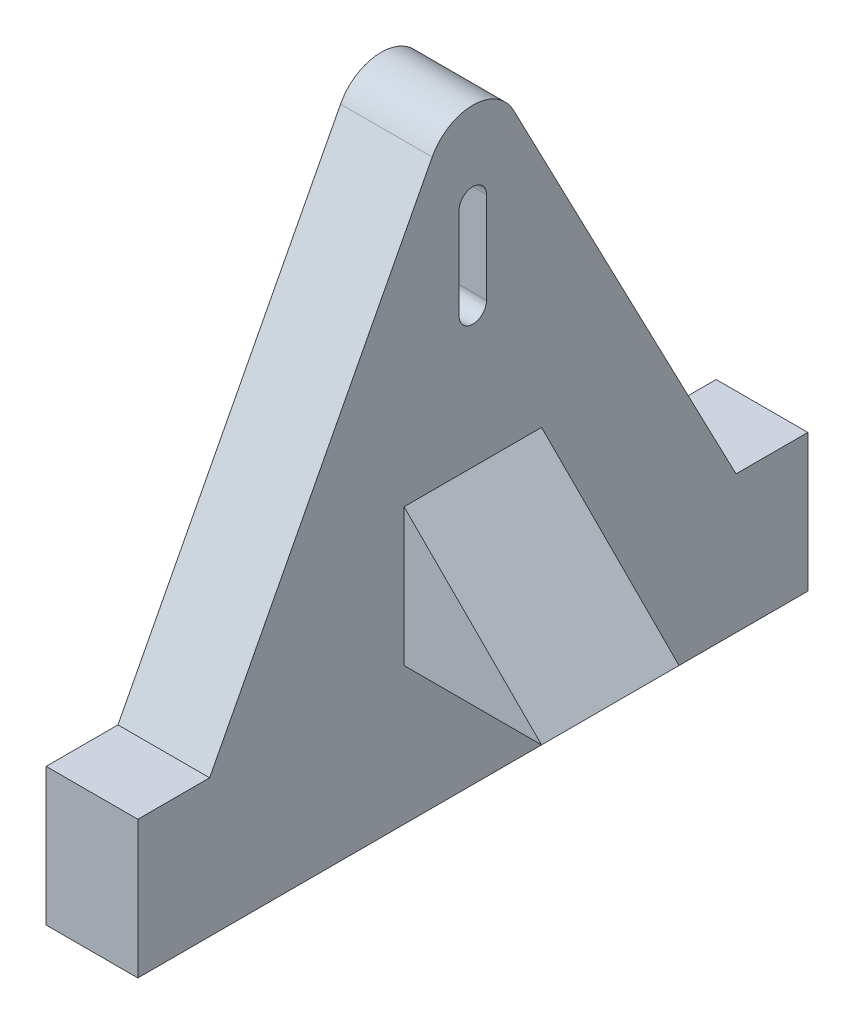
ISO-10303-21;
HEADER;
FILE_DESCRIPTION(('STEP AP214'),'2;1');
FILE_NAME('part.step','',(''),(''),'','','');
FILE_SCHEMA(('AUTOMOTIVE_DESIGN { 1 0 10303 214 1 1 1 1 }'));
ENDSEC;
DATA;
#1=APPLICATION_CONTEXT('core data for automotive mechanical design processes');
#2=APPLICATION_PROTOCOL_DEFINITION('international standard','automotive_design',2000,#1);
#3=PRODUCT_CONTEXT('',#1,'mechanical');
#4=PRODUCT('Part','Part','',(#3));
#5=PRODUCT_RELATED_PRODUCT_CATEGORY('part','',(#4));
#6=PRODUCT_DEFINITION_FORMATION('','',#4);
#7=PRODUCT_DEFINITION_CONTEXT('part definition',#1,'design');
#8=PRODUCT_DEFINITION('design','',#6,#7);
#9=PRODUCT_DEFINITION_SHAPE('','',#8);
#10=(LENGTH_UNIT() NAMED_UNIT(*) SI_UNIT(.MILLI.,.METRE.));
#11=(NAMED_UNIT(*) PLANE_ANGLE_UNIT() SI_UNIT($,.RADIAN.));
#12=(NAMED_UNIT(*) SI_UNIT($,.STERADIAN.) SOLID_ANGLE_UNIT());
#13=UNCERTAINTY_MEASURE_WITH_UNIT(LENGTH_MEASURE(1.E-05),#10,'distance_accuracy_value','');
#14=(GEOMETRIC_REPRESENTATION_CONTEXT(3) GLOBAL_UNCERTAINTY_ASSIGNED_CONTEXT((#13)) GLOBAL_UNIT_ASSIGNED_CONTEXT((#10,
#11,#12)) REPRESENTATION_CONTEXT('',''));
#15=CARTESIAN_POINT('',(0.,0.,0.));
#16=DIRECTION('',(0.,0.,1.));
#17=DIRECTION('',(1.,0.,0.));
#18=AXIS2_PLACEMENT_3D('',#15,#16,#17);
#19=CARTESIAN_POINT('',(30.,53.0229705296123,8.86438992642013));
#20=DIRECTION('',(0.,-0.462845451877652,-0.886438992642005));
#21=DIRECTION('',(0.,0.886438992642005,-0.462845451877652));
#22=AXIS2_PLACEMENT_3D('',#19,#20,#21);
#23=PLANE('',#22);
#24=DIRECTION('',(-1.,0.,0.));
#25=VECTOR('',#24,1.);
#26=CARTESIAN_POINT('',(30.,53.0229705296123,8.86438992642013));
#27=LINE('',#26,#25);
#28=CARTESIAN_POINT('',(30.,53.0229705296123,8.86438992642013));
#29=VERTEX_POINT('',#28);
#30=CARTESIAN_POINT('',(10.,53.0229705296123,8.86438992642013));
#31=VERTEX_POINT('',#30);
#32=EDGE_CURVE('E48',#29,#31,#27,.T.);
#33=ORIENTED_EDGE('',*,*,#32,.T.);
#34=DIRECTION('',(0.,-0.886438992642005,0.462845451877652));
#35=VECTOR('',#34,1.);
#36=CARTESIAN_POINT('',(10.,53.0229705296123,8.86438992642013));
#37=LINE('',#36,#35);
#38=CARTESIAN_POINT('',(10.,-40.,57.4354243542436));
#39=VERTEX_POINT('',#38);
#40=EDGE_CURVE('E249',#31,#39,#37,.T.);
#41=ORIENTED_EDGE('',*,*,#40,.T.);
#42=DIRECTION('',(-1.,0.,0.));
#43=VECTOR('',#42,1.);
#44=CARTESIAN_POINT('',(30.,-40.,57.4354243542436));
#45=LINE('',#44,#43);
#46=CARTESIAN_POINT('',(30.,-40.,57.4354243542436));
#47=VERTEX_POINT('',#46);
#48=EDGE_CURVE('E212',#47,#39,#45,.T.);
#49=ORIENTED_EDGE('',*,*,#48,.F.);
#50=DIRECTION('',(0.,-0.886438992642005,0.462845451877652));
#51=VECTOR('',#50,1.);
#52=CARTESIAN_POINT('',(30.,53.0229705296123,8.86438992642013));
#53=LINE('',#52,#51);
#54=EDGE_CURVE('E218',#29,#47,#53,.T.);
#55=ORIENTED_EDGE('',*,*,#54,.F.);
#56=EDGE_LOOP('',(#33,#41,#49,#55));
#57=FACE_BOUND('',#56,.T.);
#58=ADVANCED_FACE('F40',(#57),#23,.F.);
#59=CARTESIAN_POINT('',(30.,53.0229705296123,-8.86438992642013));
#60=DIRECTION('',(0.,0.462845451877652,-0.886438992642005));
#61=DIRECTION('',(0.,0.886438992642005,0.462845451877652));
#62=AXIS2_PLACEMENT_3D('',#59,#60,#61);
#63=PLANE('',#62);
#64=DIRECTION('',(0.,-0.886438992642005,-0.462845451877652));
#65=VECTOR('',#64,1.);
#66=CARTESIAN_POINT('',(10.,53.0229705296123,-8.86438992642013));
#67=LINE('',#66,#65);
#68=CARTESIAN_POINT('',(10.,53.0229705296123,-8.86438992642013));
#69=VERTEX_POINT('',#68);
#70=CARTESIAN_POINT('',(10.,-40.,-57.4354243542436));
#71=VERTEX_POINT('',#70);
#72=EDGE_CURVE('E255',#69,#71,#67,.T.);
#73=ORIENTED_EDGE('',*,*,#72,.F.);
#74=DIRECTION('',(-1.,0.,0.));
#75=VECTOR('',#74,1.);
#76=CARTESIAN_POINT('',(30.,53.0229705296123,-8.86438992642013));
#77=LINE('',#76,#75);
#78=CARTESIAN_POINT('',(30.,53.0229705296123,-8.86438992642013));
#79=VERTEX_POINT('',#78);
#80=EDGE_CURVE('E168',#79,#69,#77,.T.);
#81=ORIENTED_EDGE('',*,*,#80,.F.);
#82=DIRECTION('',(0.,-0.886438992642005,-0.462845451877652));
#83=VECTOR('',#82,1.);
#84=CARTESIAN_POINT('',(30.,53.0229705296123,-8.86438992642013));
#85=LINE('',#84,#83);
#86=CARTESIAN_POINT('',(30.,-40.,-57.4354243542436));
#87=VERTEX_POINT('',#86);
#88=EDGE_CURVE('E172',#79,#87,#85,.T.);
#89=ORIENTED_EDGE('',*,*,#88,.T.);
#90=DIRECTION('',(-1.,0.,0.));
#91=VECTOR('',#90,1.);
#92=CARTESIAN_POINT('',(30.,-40.,-57.4354243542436));
#93=LINE('',#92,#91);
#94=EDGE_CURVE('E208',#87,#71,#93,.T.);
#95=ORIENTED_EDGE('',*,*,#94,.T.);
#96=EDGE_LOOP('',(#73,#81,#89,#95));
#97=FACE_BOUND('',#96,.T.);
#98=ADVANCED_FACE('F225',(#97),#63,.T.);
#99=CARTESIAN_POINT('',(30.,48.394516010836,0.));
#100=DIRECTION('',(-1.,0.,0.));
#101=DIRECTION('',(0.,0.,1.));
#102=AXIS2_PLACEMENT_3D('',#99,#100,#101);
#103=CYLINDRICAL_SURFACE('',#102,10.);
#104=ORIENTED_EDGE('',*,*,#80,.T.);
#105=CARTESIAN_POINT('',(10.,48.394516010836,0.));
#106=DIRECTION('',(1.,0.,0.));
#107=DIRECTION('',(0.,0.,-1.));
#108=AXIS2_PLACEMENT_3D('',#105,#106,#107);
#109=CIRCLE('',#108,10.);
#110=EDGE_CURVE('E252',#69,#31,#109,.T.);
#111=ORIENTED_EDGE('',*,*,#110,.T.);
#112=ORIENTED_EDGE('',*,*,#32,.F.);
#113=CARTESIAN_POINT('',(30.,48.394516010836,0.));
#114=DIRECTION('',(1.,0.,0.));
#115=DIRECTION('',(0.,0.,-1.));
#116=AXIS2_PLACEMENT_3D('',#113,#114,#115);
#117=CIRCLE('',#116,10.);
#118=EDGE_CURVE('E215',#79,#29,#117,.T.);
#119=ORIENTED_EDGE('',*,*,#118,.F.);
#120=EDGE_LOOP('',(#104,#111,#112,#119));
#121=FACE_BOUND('',#120,.T.);
#122=ADVANCED_FACE('F42',(#121),#103,.T.);
#123=CARTESIAN_POINT('',(30.,-70.,73.09963099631));
#124=DIRECTION('',(0.,1.,0.));
#125=DIRECTION('',(0.,0.,1.));
#126=AXIS2_PLACEMENT_3D('',#123,#124,#125);
#127=PLANE('',#126);
#128=DIRECTION('',(-1.,0.,0.));
#129=VECTOR('',#128,1.);
#130=CARTESIAN_POINT('',(30.,-70.,73.09963099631));
#131=LINE('',#130,#129);
#132=CARTESIAN_POINT('',(30.,-70.,73.09963099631));
#133=VERTEX_POINT('',#132);
#134=CARTESIAN_POINT('',(10.,-70.,73.09963099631));
#135=VERTEX_POINT('',#134);
#136=EDGE_CURVE('E161',#133,#135,#131,.T.);
#137=ORIENTED_EDGE('',*,*,#136,.T.);
#138=DIRECTION('',(0.,0.,-1.));
#139=VECTOR('',#138,1.);
#140=CARTESIAN_POINT('',(10.,-70.,73.09963099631));
#141=LINE('',#140,#139);
#142=CARTESIAN_POINT('',(10.,-70.,-73.09963099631));
#143=VERTEX_POINT('',#142);
#144=EDGE_CURVE('E55',#135,#143,#141,.T.);
#145=ORIENTED_EDGE('',*,*,#144,.T.);
#146=DIRECTION('',(-1.,0.,0.));
#147=VECTOR('',#146,1.);
#148=CARTESIAN_POINT('',(30.,-70.,-73.09963099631));
#149=LINE('',#148,#147);
#150=CARTESIAN_POINT('',(30.,-70.,-73.09963099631));
#151=VERTEX_POINT('',#150);
#152=EDGE_CURVE('E158',#151,#143,#149,.T.);
#153=ORIENTED_EDGE('',*,*,#152,.F.);
#154=DIRECTION('',(0.,0.,-1.));
#155=VECTOR('',#154,1.);
#156=CARTESIAN_POINT('',(30.,-70.,73.09963099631));
#157=LINE('',#156,#155);
#158=EDGE_CURVE('E220',#133,#151,#157,.T.);
#159=ORIENTED_EDGE('',*,*,#158,.F.);
#160=EDGE_LOOP('',(#137,#145,#153,#159));
#161=FACE_BOUND('',#160,.T.);
#162=ADVANCED_FACE('F156',(#161),#127,.F.);
#163=CARTESIAN_POINT('',(30.,48.394516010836,0.));
#164=DIRECTION('',(1.,0.,0.));
#165=DIRECTION('',(0.,0.,-1.));
#166=AXIS2_PLACEMENT_3D('',#163,#164,#165);
#167=PLANE('',#166);
#168=DIRECTION('',(0.,-1.,0.));
#169=VECTOR('',#168,1.);
#170=CARTESIAN_POINT('',(30.,-40.,15.));
#171=LINE('',#170,#169);
#172=CARTESIAN_POINT('',(30.,-10.,15.));
#173=VERTEX_POINT('',#172);
#174=CARTESIAN_POINT('',(30.,-40.,15.));
#175=VERTEX_POINT('',#174);
#176=EDGE_CURVE('E272',#173,#175,#171,.T.);
#177=ORIENTED_EDGE('',*,*,#176,.F.);
#178=DIRECTION('',(0.,0.,1.));
#179=VECTOR('',#178,1.);
#180=CARTESIAN_POINT('',(30.,-10.,15.));
#181=LINE('',#180,#179);
#182=CARTESIAN_POINT('',(30.,-10.,-15.));
#183=VERTEX_POINT('',#182);
#184=EDGE_CURVE('E270',#183,#173,#181,.T.);
#185=ORIENTED_EDGE('',*,*,#184,.F.);
#186=DIRECTION('',(0.,1.,0.));
#187=VECTOR('',#186,1.);
#188=CARTESIAN_POINT('',(30.,-40.,-15.));
#189=LINE('',#188,#187);
#190=CARTESIAN_POINT('',(30.,-40.,-15.));
#191=VERTEX_POINT('',#190);
#192=EDGE_CURVE('E263',#191,#183,#189,.T.);
#193=ORIENTED_EDGE('',*,*,#192,.F.);
#194=DIRECTION('',(0.,0.,-1.));
#195=VECTOR('',#194,1.);
#196=CARTESIAN_POINT('',(30.,-40.,15.));
#197=LINE('',#196,#195);
#198=EDGE_CURVE('E267',#175,#191,#197,.T.);
#199=ORIENTED_EDGE('',*,*,#198,.F.);
#200=EDGE_LOOP('',(#177,#185,#193,#199));
#201=FACE_BOUND('',#200,.T.);
#202=ORIENTED_EDGE('',*,*,#54,.T.);
#203=DIRECTION('',(0.,0.,1.));
#204=VECTOR('',#203,1.);
#205=CARTESIAN_POINT('',(30.,-40.,73.09963099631));
#206=LINE('',#205,#204);
#207=CARTESIAN_POINT('',(30.,-40.,73.09963099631));
#208=VERTEX_POINT('',#207);
#209=EDGE_CURVE('E194',#47,#208,#206,.T.);
#210=ORIENTED_EDGE('',*,*,#209,.T.);
#211=DIRECTION('',(0.,-1.,0.));
#212=VECTOR('',#211,1.);
#213=CARTESIAN_POINT('',(30.,-40.,73.09963099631));
#214=LINE('',#213,#212);
#215=EDGE_CURVE('E206',#208,#133,#214,.T.);
#216=ORIENTED_EDGE('',*,*,#215,.T.);
#217=ORIENTED_EDGE('',*,*,#158,.T.);
#218=DIRECTION('',(0.,-1.,0.));
#219=VECTOR('',#218,1.);
#220=CARTESIAN_POINT('',(30.,-40.,-73.09963099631));
#221=LINE('',#220,#219);
#222=CARTESIAN_POINT('',(30.,-40.,-73.09963099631));
#223=VERTEX_POINT('',#222);
#224=EDGE_CURVE('E167',#223,#151,#221,.T.);
#225=ORIENTED_EDGE('',*,*,#224,.F.);
#226=EDGE_CURVE('E196',#223,#87,#206,.T.);
#227=ORIENTED_EDGE('',*,*,#226,.T.);
#228=ORIENTED_EDGE('',*,*,#88,.F.);
#229=ORIENTED_EDGE('',*,*,#118,.T.);
#230=EDGE_LOOP('',(#202,#210,#216,#217,#225,#227,#228,#229));
#231=FACE_BOUND('',#230,.T.);
#232=CARTESIAN_POINT('',(30.,20.,0.));
#233=DIRECTION('',(1.,0.,0.));
#234=DIRECTION('',(0.,0.,-1.));
#235=AXIS2_PLACEMENT_3D('',#232,#233,#234);
#236=CIRCLE('',#235,3.);
#237=CARTESIAN_POINT('',(30.,20.,3.));
#238=VERTEX_POINT('',#237);
#239=CARTESIAN_POINT('',(30.,20.,-3.));
#240=VERTEX_POINT('',#239);
#241=EDGE_CURVE('E187',#238,#240,#236,.T.);
#242=ORIENTED_EDGE('',*,*,#241,.F.);
#243=DIRECTION('',(0.,-1.,0.));
#244=VECTOR('',#243,1.);
#245=CARTESIAN_POINT('',(30.,20.,3.));
#246=LINE('',#245,#244);
#247=CARTESIAN_POINT('',(30.,40.,3.));
#248=VERTEX_POINT('',#247);
#249=EDGE_CURVE('E185',#248,#238,#246,.T.);
#250=ORIENTED_EDGE('',*,*,#249,.F.);
#251=CARTESIAN_POINT('',(30.,40.,0.));
#252=DIRECTION('',(1.,0.,0.));
#253=DIRECTION('',(0.,0.,-1.));
#254=AXIS2_PLACEMENT_3D('',#251,#252,#253);
#255=CIRCLE('',#254,3.);
#256=CARTESIAN_POINT('',(30.,40.,-3.));
#257=VERTEX_POINT('',#256);
#258=EDGE_CURVE('E181',#257,#248,#255,.T.);
#259=ORIENTED_EDGE('',*,*,#258,.F.);
#260=DIRECTION('',(0.,1.,0.));
#261=VECTOR('',#260,1.);
#262=CARTESIAN_POINT('',(30.,20.,-3.));
#263=LINE('',#262,#261);
#264=EDGE_CURVE('E178',#240,#257,#263,.T.);
#265=ORIENTED_EDGE('',*,*,#264,.F.);
#266=EDGE_LOOP('',(#242,#250,#259,#265));
#267=FACE_BOUND('',#266,.T.);
#268=ADVANCED_FACE('F231',(#201,#231,#267),#167,.T.);
#269=CARTESIAN_POINT('',(0.,-40.,-73.09963099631));
#270=DIRECTION('',(0.,0.,-1.));
#271=DIRECTION('',(-1.,0.,0.));
#272=AXIS2_PLACEMENT_3D('',#269,#270,#271);
#273=PLANE('',#272);
#274=DIRECTION('',(0.,-1.,0.));
#275=VECTOR('',#274,1.);
#276=CARTESIAN_POINT('',(10.,-40.,-73.09963099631));
#277=LINE('',#276,#275);
#278=CARTESIAN_POINT('',(10.,-40.,-73.09963099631));
#279=VERTEX_POINT('',#278);
#280=EDGE_CURVE('E144',#279,#143,#277,.T.);
#281=ORIENTED_EDGE('',*,*,#280,.F.);
#282=DIRECTION('',(1.,0.,0.));
#283=VECTOR('',#282,1.);
#284=CARTESIAN_POINT('',(0.,-40.,-73.09963099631));
#285=LINE('',#284,#283);
#286=EDGE_CURVE('E189',#279,#223,#285,.T.);
#287=ORIENTED_EDGE('',*,*,#286,.T.);
#288=ORIENTED_EDGE('',*,*,#224,.T.);
#289=ORIENTED_EDGE('',*,*,#152,.T.);
#290=EDGE_LOOP('',(#281,#287,#288,#289));
#291=FACE_BOUND('',#290,.T.);
#292=ADVANCED_FACE('F165',(#291),#273,.T.);
#293=CARTESIAN_POINT('',(0.,-40.,0.));
#294=DIRECTION('',(0.,-1.,0.));
#295=DIRECTION('',(0.,0.,-1.));
#296=AXIS2_PLACEMENT_3D('',#293,#294,#295);
#297=PLANE('',#296);
#298=ORIENTED_EDGE('',*,*,#286,.F.);
#299=DIRECTION('',(0.,0.,1.));
#300=VECTOR('',#299,1.);
#301=CARTESIAN_POINT('',(10.,-40.,0.));
#302=LINE('',#301,#300);
#303=EDGE_CURVE('E147',#279,#71,#302,.T.);
#304=ORIENTED_EDGE('',*,*,#303,.T.);
#305=ORIENTED_EDGE('',*,*,#94,.F.);
#306=ORIENTED_EDGE('',*,*,#226,.F.);
#307=EDGE_LOOP('',(#298,#304,#305,#306));
#308=FACE_BOUND('',#307,.T.);
#309=ADVANCED_FACE('F230',(#308),#297,.F.);
#310=ORIENTED_EDGE('',*,*,#48,.T.);
#311=DIRECTION('',(0.,0.,1.));
#312=VECTOR('',#311,1.);
#313=CARTESIAN_POINT('',(10.,-40.,0.));
#314=LINE('',#313,#312);
#315=CARTESIAN_POINT('',(10.,-40.,73.09963099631));
#316=VERTEX_POINT('',#315);
#317=EDGE_CURVE('E247',#39,#316,#314,.T.);
#318=ORIENTED_EDGE('',*,*,#317,.T.);
#319=DIRECTION('',(-1.,0.,0.));
#320=VECTOR('',#319,1.);
#321=CARTESIAN_POINT('',(0.,-40.,73.09963099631));
#322=LINE('',#321,#320);
#323=EDGE_CURVE('E203',#208,#316,#322,.T.);
#324=ORIENTED_EDGE('',*,*,#323,.F.);
#325=ORIENTED_EDGE('',*,*,#209,.F.);
#326=EDGE_LOOP('',(#310,#318,#324,#325));
#327=FACE_BOUND('',#326,.T.);
#328=ADVANCED_FACE('F304',(#327),#297,.F.);
#329=CARTESIAN_POINT('',(0.,-40.,73.09963099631));
#330=DIRECTION('',(0.,0.,1.));
#331=DIRECTION('',(1.,0.,0.));
#332=AXIS2_PLACEMENT_3D('',#329,#330,#331);
#333=PLANE('',#332);
#334=DIRECTION('',(0.,-1.,0.));
#335=VECTOR('',#334,1.);
#336=CARTESIAN_POINT('',(10.,-70.,73.09963099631));
#337=LINE('',#336,#335);
#338=EDGE_CURVE('E163',#316,#135,#337,.T.);
#339=ORIENTED_EDGE('',*,*,#338,.T.);
#340=ORIENTED_EDGE('',*,*,#136,.F.);
#341=ORIENTED_EDGE('',*,*,#215,.F.);
#342=ORIENTED_EDGE('',*,*,#323,.T.);
#343=EDGE_LOOP('',(#339,#340,#341,#342));
#344=FACE_BOUND('',#343,.T.);
#345=ADVANCED_FACE('F237',(#344),#333,.T.);
#346=CARTESIAN_POINT('',(0.,20.,0.));
#347=DIRECTION('',(1.,0.,0.));
#348=DIRECTION('',(0.,0.,-1.));
#349=AXIS2_PLACEMENT_3D('',#346,#347,#348);
#350=CYLINDRICAL_SURFACE('',#349,3.);
#351=DIRECTION('',(1.,0.,0.));
#352=VECTOR('',#351,1.);
#353=CARTESIAN_POINT('',(0.,20.,-3.));
#354=LINE('',#353,#352);
#355=CARTESIAN_POINT('',(10.,20.,-3.));
#356=VERTEX_POINT('',#355);
#357=EDGE_CURVE('E282',#356,#240,#354,.T.);
#358=ORIENTED_EDGE('',*,*,#357,.F.);
#359=CARTESIAN_POINT('',(10.,20.,0.));
#360=DIRECTION('',(1.,0.,0.));
#361=DIRECTION('',(0.,0.,-1.));
#362=AXIS2_PLACEMENT_3D('',#359,#360,#361);
#363=CIRCLE('',#362,3.);
#364=CARTESIAN_POINT('',(10.,20.,3.));
#365=VERTEX_POINT('',#364);
#366=EDGE_CURVE('E63',#356,#365,#363,.F.);
#367=ORIENTED_EDGE('',*,*,#366,.T.);
#368=DIRECTION('',(1.,0.,0.));
#369=VECTOR('',#368,1.);
#370=CARTESIAN_POINT('',(0.,20.,3.));
#371=LINE('',#370,#369);
#372=EDGE_CURVE('E182',#365,#238,#371,.T.);
#373=ORIENTED_EDGE('',*,*,#372,.T.);
#374=ORIENTED_EDGE('',*,*,#241,.T.);
#375=EDGE_LOOP('',(#358,#367,#373,#374));
#376=FACE_BOUND('',#375,.T.);
#377=ADVANCED_FACE('F296',(#376),#350,.F.);
#378=CARTESIAN_POINT('',(0.,20.,3.));
#379=DIRECTION('',(0.,0.,1.));
#380=DIRECTION('',(0.,-1.,0.));
#381=AXIS2_PLACEMENT_3D('',#378,#379,#380);
#382=PLANE('',#381);
#383=ORIENTED_EDGE('',*,*,#372,.F.);
#384=DIRECTION('',(0.,1.,0.));
#385=VECTOR('',#384,1.);
#386=CARTESIAN_POINT('',(10.,20.,3.));
#387=LINE('',#386,#385);
#388=CARTESIAN_POINT('',(10.,40.,3.));
#389=VERTEX_POINT('',#388);
#390=EDGE_CURVE('E243',#365,#389,#387,.T.);
#391=ORIENTED_EDGE('',*,*,#390,.T.);
#392=DIRECTION('',(1.,0.,0.));
#393=VECTOR('',#392,1.);
#394=CARTESIAN_POINT('',(0.,40.,3.));
#395=LINE('',#394,#393);
#396=EDGE_CURVE('E283',#389,#248,#395,.T.);
#397=ORIENTED_EDGE('',*,*,#396,.T.);
#398=ORIENTED_EDGE('',*,*,#249,.T.);
#399=EDGE_LOOP('',(#383,#391,#397,#398));
#400=FACE_BOUND('',#399,.T.);
#401=ADVANCED_FACE('F295',(#400),#382,.F.);
#402=CARTESIAN_POINT('',(0.,40.,0.));
#403=DIRECTION('',(1.,0.,0.));
#404=DIRECTION('',(0.,0.,-1.));
#405=AXIS2_PLACEMENT_3D('',#402,#403,#404);
#406=CYLINDRICAL_SURFACE('',#405,3.);
#407=ORIENTED_EDGE('',*,*,#396,.F.);
#408=CARTESIAN_POINT('',(10.,40.,0.));
#409=DIRECTION('',(1.,0.,0.));
#410=DIRECTION('',(0.,0.,-1.));
#411=AXIS2_PLACEMENT_3D('',#408,#409,#410);
#412=CIRCLE('',#411,3.);
#413=CARTESIAN_POINT('',(10.,40.,-3.));
#414=VERTEX_POINT('',#413);
#415=EDGE_CURVE('E162',#389,#414,#412,.F.);
#416=ORIENTED_EDGE('',*,*,#415,.T.);
#417=DIRECTION('',(1.,0.,0.));
#418=VECTOR('',#417,1.);
#419=CARTESIAN_POINT('',(0.,40.,-3.));
#420=LINE('',#419,#418);
#421=EDGE_CURVE('E199',#414,#257,#420,.T.);
#422=ORIENTED_EDGE('',*,*,#421,.T.);
#423=ORIENTED_EDGE('',*,*,#258,.T.);
#424=EDGE_LOOP('',(#407,#416,#422,#423));
#425=FACE_BOUND('',#424,.T.);
#426=ADVANCED_FACE('F289',(#425),#406,.F.);
#427=CARTESIAN_POINT('',(0.,20.,-3.));
#428=DIRECTION('',(0.,0.,-1.));
#429=DIRECTION('',(0.,1.,0.));
#430=AXIS2_PLACEMENT_3D('',#427,#428,#429);
#431=PLANE('',#430);
#432=ORIENTED_EDGE('',*,*,#421,.F.);
#433=DIRECTION('',(0.,-1.,0.));
#434=VECTOR('',#433,1.);
#435=CARTESIAN_POINT('',(10.,20.,-3.));
#436=LINE('',#435,#434);
#437=EDGE_CURVE('E11',#414,#356,#436,.T.);
#438=ORIENTED_EDGE('',*,*,#437,.T.);
#439=ORIENTED_EDGE('',*,*,#357,.T.);
#440=ORIENTED_EDGE('',*,*,#264,.T.);
#441=EDGE_LOOP('',(#432,#438,#439,#440));
#442=FACE_BOUND('',#441,.T.);
#443=ADVANCED_FACE('F292',(#442),#431,.F.);
#444=CARTESIAN_POINT('',(60.,-40.,-15.));
#445=DIRECTION('',(0.,0.,1.));
#446=DIRECTION('',(1.,0.,0.));
#447=AXIS2_PLACEMENT_3D('',#444,#445,#446);
#448=PLANE('',#447);
#449=ORIENTED_EDGE('',*,*,#192,.T.);
#450=DIRECTION('',(0.707106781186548,-0.707106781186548,0.));
#451=VECTOR('',#450,1.);
#452=CARTESIAN_POINT('',(60.,-40.,-15.));
#453=LINE('',#452,#451);
#454=CARTESIAN_POINT('',(60.,-40.,-15.));
#455=VERTEX_POINT('',#454);
#456=EDGE_CURVE('E260',#183,#455,#453,.T.);
#457=ORIENTED_EDGE('',*,*,#456,.T.);
#458=DIRECTION('',(-1.,0.,0.));
#459=VECTOR('',#458,1.);
#460=CARTESIAN_POINT('',(60.,-40.,-15.));
#461=LINE('',#460,#459);
#462=EDGE_CURVE('E266',#455,#191,#461,.T.);
#463=ORIENTED_EDGE('',*,*,#462,.T.);
#464=EDGE_LOOP('',(#449,#457,#463));
#465=FACE_BOUND('',#464,.T.);
#466=ADVANCED_FACE('F394',(#465),#448,.F.);
#467=CARTESIAN_POINT('',(60.,-40.,15.));
#468=DIRECTION('',(0.,0.,-1.));
#469=DIRECTION('',(-1.,0.,0.));
#470=AXIS2_PLACEMENT_3D('',#467,#468,#469);
#471=PLANE('',#470);
#472=DIRECTION('',(-1.,0.,0.));
#473=VECTOR('',#472,1.);
#474=CARTESIAN_POINT('',(60.,-40.,15.));
#475=LINE('',#474,#473);
#476=CARTESIAN_POINT('',(60.,-40.,15.));
#477=VERTEX_POINT('',#476);
#478=EDGE_CURVE('E279',#477,#175,#475,.T.);
#479=ORIENTED_EDGE('',*,*,#478,.F.);
#480=DIRECTION('',(-0.707106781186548,0.707106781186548,0.));
#481=VECTOR('',#480,1.);
#482=CARTESIAN_POINT('',(60.,-40.,15.));
#483=LINE('',#482,#481);
#484=EDGE_CURVE('E151',#477,#173,#483,.T.);
#485=ORIENTED_EDGE('',*,*,#484,.T.);
#486=ORIENTED_EDGE('',*,*,#176,.T.);
#487=EDGE_LOOP('',(#479,#485,#486));
#488=FACE_BOUND('',#487,.T.);
#489=ADVANCED_FACE('F403',(#488),#471,.F.);
#490=CARTESIAN_POINT('',(60.,-40.,15.));
#491=DIRECTION('',(0.,1.,0.));
#492=DIRECTION('',(0.,0.,1.));
#493=AXIS2_PLACEMENT_3D('',#490,#491,#492);
#494=PLANE('',#493);
#495=ORIENTED_EDGE('',*,*,#198,.T.);
#496=ORIENTED_EDGE('',*,*,#462,.F.);
#497=DIRECTION('',(0.,0.,-1.));
#498=VECTOR('',#497,1.);
#499=CARTESIAN_POINT('',(60.,-40.,15.));
#500=LINE('',#499,#498);
#501=EDGE_CURVE('E264',#477,#455,#500,.T.);
#502=ORIENTED_EDGE('',*,*,#501,.F.);
#503=ORIENTED_EDGE('',*,*,#478,.T.);
#504=EDGE_LOOP('',(#495,#496,#502,#503));
#505=FACE_BOUND('',#504,.T.);
#506=ADVANCED_FACE('F413',(#505),#494,.F.);
#507=CARTESIAN_POINT('',(60.,-40.,73.09963099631));
#508=DIRECTION('',(-0.707106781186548,-0.707106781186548,0.));
#509=DIRECTION('',(0.707106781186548,-0.707106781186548,0.));
#510=AXIS2_PLACEMENT_3D('',#507,#508,#509);
#511=PLANE('',#510);
#512=ORIENTED_EDGE('',*,*,#184,.T.);
#513=ORIENTED_EDGE('',*,*,#484,.F.);
#514=ORIENTED_EDGE('',*,*,#501,.T.);
#515=ORIENTED_EDGE('',*,*,#456,.F.);
#516=EDGE_LOOP('',(#512,#513,#514,#515));
#517=FACE_BOUND('',#516,.T.);
#518=ADVANCED_FACE('F423',(#517),#511,.F.);
#519=CARTESIAN_POINT('',(10.,-70.,73.09963099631));
#520=DIRECTION('',(1.,0.,0.));
#521=DIRECTION('',(0.,0.,-1.));
#522=AXIS2_PLACEMENT_3D('',#519,#520,#521);
#523=PLANE('',#522);
#524=ORIENTED_EDGE('',*,*,#280,.T.);
#525=ORIENTED_EDGE('',*,*,#144,.F.);
#526=ORIENTED_EDGE('',*,*,#338,.F.);
#527=ORIENTED_EDGE('',*,*,#317,.F.);
#528=ORIENTED_EDGE('',*,*,#40,.F.);
#529=ORIENTED_EDGE('',*,*,#110,.F.);
#530=ORIENTED_EDGE('',*,*,#72,.T.);
#531=ORIENTED_EDGE('',*,*,#303,.F.);
#532=EDGE_LOOP('',(#524,#525,#526,#527,#528,#529,#530,#531));
#533=FACE_BOUND('',#532,.T.);
#534=ORIENTED_EDGE('',*,*,#437,.F.);
#535=ORIENTED_EDGE('',*,*,#415,.F.);
#536=ORIENTED_EDGE('',*,*,#390,.F.);
#537=ORIENTED_EDGE('',*,*,#366,.F.);
#538=EDGE_LOOP('',(#534,#535,#536,#537));
#539=FACE_BOUND('',#538,.T.);
#540=ADVANCED_FACE('F145',(#533,#539),#523,.F.);
#541=CLOSED_SHELL('',(#58,#98,#122,#162,#268,#292,#309,#328,#345,#377,#401,#426,#443,#466,#489,
#506,#518,#540));
#542=MANIFOLD_SOLID_BREP('B2',#541);
#543=ADVANCED_BREP_SHAPE_REPRESENTATION('',(#18,#542),#14);
#544=SHAPE_DEFINITION_REPRESENTATION(#9,#543);
ENDSEC;
END-ISO-10303-21;
